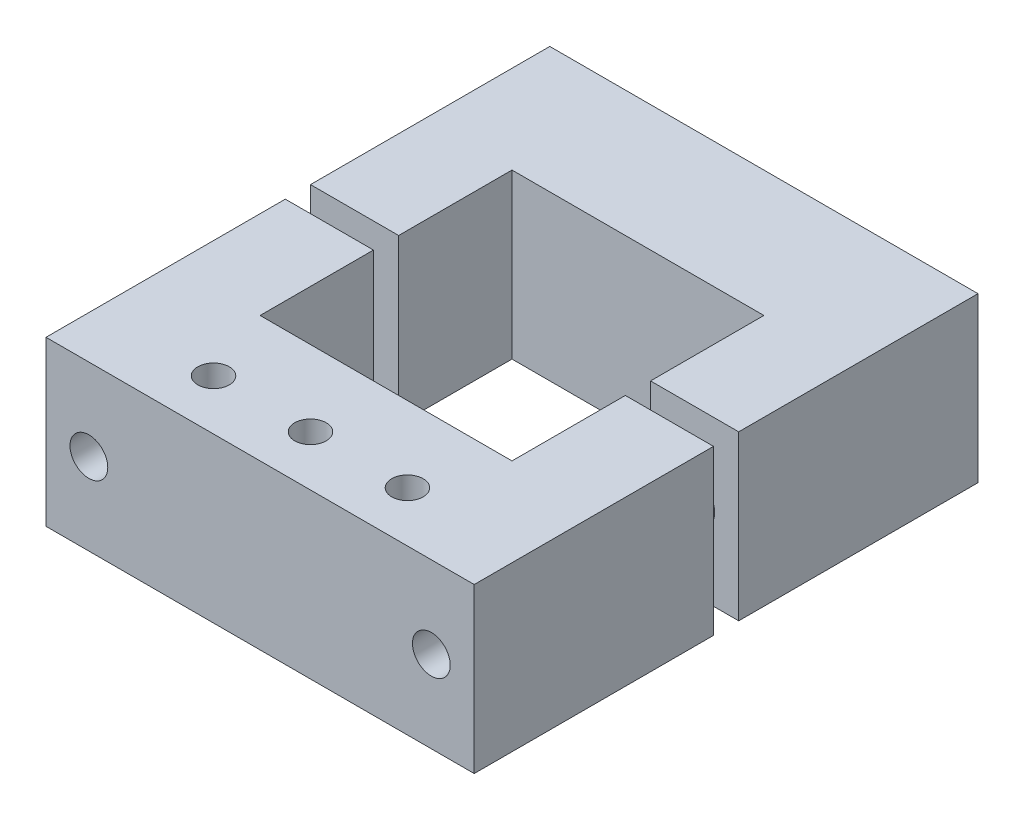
from build123d import *

# Parameters (mm, degrees)
BOSS_EXTRUDE1_DEPTH      = 10
BOSS_EXTRUDE1_DEPTH_BACK = 30
SKETCH1_W                = 34
SKETCH1_H                = 13
SKETCH1_R                = 1.5
SKETCH2_R                = 1.25
CUT_EXTRUDE1_DEPTH       = 20


with BuildPart() as part:
    # Sketch1 → Boss-Extrude1 (new, two sides: drawn at the far end of the back side and taken through both)
    with BuildSketch(Plane.XY.offset(-BOSS_EXTRUDE1_DEPTH_BACK)):
        with Locations((227.342156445, -142.558532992)):
            Rectangle(SKETCH1_W, SKETCH1_H)
        with Locations((213.745973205, -142.558532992)):
            Circle(SKETCH1_R, mode=Mode.SUBTRACT)
        with Locations(Location((240.938339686, -142.558532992, 0), (0, 0, 180))):
            Circle(SKETCH1_R, mode=Mode.SUBTRACT)
    extrude(amount=BOSS_EXTRUDE1_DEPTH + BOSS_EXTRUDE1_DEPTH_BACK)

    # Sketch2 → Cut-Extrude1 (cut)
    with BuildSketch(Plane(origin=(0, -136.058532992, 0), x_dir=(-1, 0, 0), z_dir=(0, 1, 0))):
        with Locations(Location((-235.040096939, 6, 0), (0, 0, 90))):
            Circle(SKETCH2_R)
        with Locations(Location((-227.342156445, 6, 0), (0, 0, 90))):
            Circle(SKETCH2_R)
        with Locations(Location((-219.644215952, 6, 0), (0, 0, 90))):
            Circle(SKETCH2_R)
        Polygon((-237.342156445, -20), (-217.342156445, -20), (-217.342156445, -11), (-210.342156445, -11), (-210.342156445, -9), (-217.342156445, -9), (-217.342156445, 0), (-237.342156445, 0), (-237.342156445, -9), (-244.342156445, -9), (-244.342156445, -11), (-237.342156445, -11), align=None)
    extrude(amount=-CUT_EXTRUDE1_DEPTH, mode=Mode.SUBTRACT)


with BuildPart() as cut_extrude1_piece_1:
    # of the separate pieces the step leaves, piece 1, a body of its own (cut_extrude1_pieces)
    add(part.part.solids().sort_by_distance((244.342156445, -136.058532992, -30))[0])


with BuildPart() as cut_extrude1_piece_2:
    # of the separate pieces the step leaves, piece 2, a body of its own (cut_extrude1_pieces)
    add(part.part.solids().sort_by_distance((244.342156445, -136.058532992, -9))[0])


solid = Compound([cut_extrude1_piece_1.part, cut_extrude1_piece_2.part])
